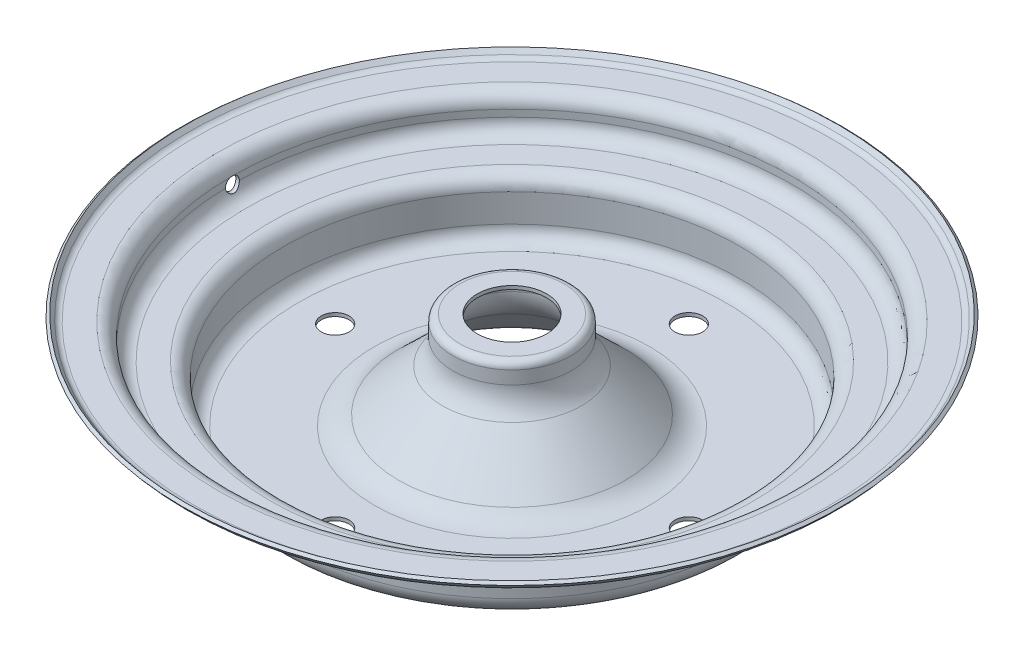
from build123d import *
from build123d.topology import SkipClean

# Parameters (mm, degrees)
IZIM2_R                    = 4
KES_EKSTR_ZYON1_DEPTH      = 10
KES_EKSTR_ZYON4_DEPTH      = 11
KES_EKSTR_ZYON4_DEPTH_BACK = 11
IZIM3_R                    = 2


with BuildPart() as part:
    # izim1 → D_nd_r1 (revolve)
    with BuildSketch(Plane.XY, mode=Mode.PRIVATE) as d_nd_r1_sk:
        with BuildLine():
            Line((-94.233955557, 34.680756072), (-93.226460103, 33.480069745))
            ThreePointArc((-93.226460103, 33.480069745), (-92.53960774, 32.95302939), (-91.694371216, 32.765644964))
            Line((-91.694371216, 32.765644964), (-84.626986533, 32.765644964))
            ThreePointArc((-84.626986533, 32.765644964), (-81.798559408, 31.594072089), (-80.626986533, 28.765644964))
            Line((-80.626986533, 28.765644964), (-80.626986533, 26.765644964))
            ThreePointArc((-80.626986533, 26.765644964), (-79.455413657, 23.93721784), (-76.626986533, 22.765644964))
            Line((-76.626986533, 22.765644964), (-69.626986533, 22.765644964))
            ThreePointArc((-69.626986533, 22.765644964), (-66.798559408, 21.594072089), (-65.626986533, 18.765644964))
            Line((-65.626986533, 18.765644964), (-65.626986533, 10.680756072))
            ThreePointArc((-65.626986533, 10.680756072), (-64.455413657, 7.852328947), (-61.626986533, 6.680756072))
            Line((-61.626986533, 6.680756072), (-39.669207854, 6.680756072))
            ThreePointArc((-39.669207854, 6.680756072), (-35.921580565, 7.409548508), (-32.72020176, 9.489698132))
            Line((-32.72020176, 9.489698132), (-20.050993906, 21.732458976))
            ThreePointArc((-20.050993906, 21.732458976), (-17.794293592, 25.017755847), (-17, 28.923516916))
            Line((-17, 28.923516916), (-17, 32.680756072))
            ThreePointArc((-17, 32.680756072), (-16.414213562, 34.094969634), (-15, 34.680756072))
            Line((-15, 34.680756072), (-10, 34.680756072))
            Line((-10, 34.680756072), (-10, 33.680756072))
            Line((-10, 33.680756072), (-11, 33.680756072))
            Line((-11, 33.680756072), (-15, 33.680756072))
            ThreePointArc((-15, 33.680756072), (-15.707106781, 33.387862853), (-16, 32.680756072))
            Line((-16, 32.680756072), (-16, 28.923516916))
            ThreePointArc((-16, 28.923516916), (-16.873722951, 24.62717974), (-19.356093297, 21.013353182))
            Line((-19.356093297, 21.013353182), (-32.02530115, 8.770592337))
            ThreePointArc((-32.02530115, 8.770592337), (-35.546817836, 6.482427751), (-39.669207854, 5.680756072))
            Line((-39.669207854, 5.680756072), (-61.626986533, 5.680756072))
            ThreePointArc((-61.626986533, 5.680756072), (-65.162520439, 7.145222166), (-66.626986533, 10.680756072))
            Line((-66.626986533, 10.680756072), (-66.626986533, 18.765644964))
            ThreePointArc((-66.626986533, 18.765644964), (-67.505666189, 20.886965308), (-69.626986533, 21.765644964))
            Line((-69.626986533, 21.765644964), (-76.626986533, 21.765644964))
            ThreePointArc((-76.626986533, 21.765644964), (-80.162520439, 23.230111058), (-81.626986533, 26.765644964))
            Line((-81.626986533, 26.765644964), (-81.626986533, 28.765644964))
            ThreePointArc((-81.626986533, 28.765644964), (-82.505666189, 30.886965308), (-84.626986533, 31.765644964))
            Line((-84.626986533, 31.765644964), (-91.694371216, 31.765644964))
            ThreePointArc((-91.694371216, 31.765644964), (-92.962226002, 32.046721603), (-93.992504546, 32.837282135))
            Line((-93.992504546, 32.837282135), (-95, 34.037968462))
            Line((-95, 34.037968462), (-94.233955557, 34.680756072))
        make_face()
    revolve(d_nd_r1_sk.sketch.rotate(Axis((0, 39.603638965, 0), (0, -1, 0)), 270), axis=Axis((0, 39.603638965, 0), (0, -1, 0)))

    # izim2 → Kes-Ekstr_zyon1 (cut)
    with BuildSketch(Plane(origin=(0, 6.680756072, 0), x_dir=(1, 0, 0), z_dir=(0, 1, 0))):
        with Locations(Location((0, 50.9725, 0), (0, 0, 270))):
            Circle(IZIM2_R)
        with Locations(Location((50.9725, 0, 0), (0, 0, 270))):
            Circle(IZIM2_R)
        with Locations(Location((0, -50.9725, 0), (0, 0, 270))):
            Circle(IZIM2_R)
        with Locations(Location((-50.9725, 0, 0), (0, 0, 270))):
            Circle(IZIM2_R)
    extrude(amount=-KES_EKSTR_ZYON1_DEPTH, mode=Mode.SUBTRACT)

    # izim3 → Kes-Ekstr_zyon4 (cut, two sides: drawn at the far end of the back side and taken through both)
    with SkipClean():  # the faces are left unmerged after this step: merging them gives an invalid solid
        with BuildSketch(Plane(origin=(-80.626986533, 0, 0), x_dir=(0, 0, -1), z_dir=(1, 0, 0)).offset(-KES_EKSTR_ZYON4_DEPTH_BACK)):
            with Locations(Location((0, 26.765644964, 0), (0, 0, 180))):
                Circle(IZIM3_R)
        extrude(amount=KES_EKSTR_ZYON4_DEPTH + KES_EKSTR_ZYON4_DEPTH_BACK, mode=Mode.SUBTRACT)


solid = part.part
